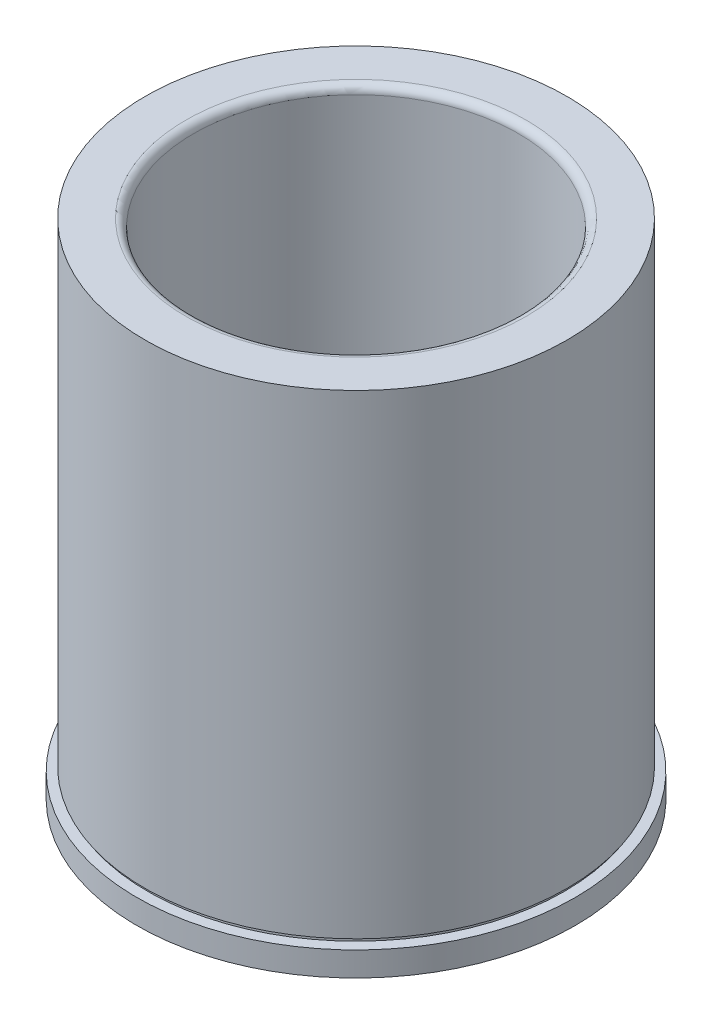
ISO-10303-21;
HEADER;
FILE_DESCRIPTION(('STEP AP214'),'2;1');
FILE_NAME('part.step','',(''),(''),'','','');
FILE_SCHEMA(('AUTOMOTIVE_DESIGN { 1 0 10303 214 1 1 1 1 }'));
ENDSEC;
DATA;
#1=APPLICATION_CONTEXT('core data for automotive mechanical design processes');
#2=APPLICATION_PROTOCOL_DEFINITION('international standard','automotive_design',2000,#1);
#3=PRODUCT_CONTEXT('',#1,'mechanical');
#4=PRODUCT('Part','Part','',(#3));
#5=PRODUCT_RELATED_PRODUCT_CATEGORY('part','',(#4));
#6=PRODUCT_DEFINITION_FORMATION('','',#4);
#7=PRODUCT_DEFINITION_CONTEXT('part definition',#1,'design');
#8=PRODUCT_DEFINITION('design','',#6,#7);
#9=PRODUCT_DEFINITION_SHAPE('','',#8);
#10=(LENGTH_UNIT() NAMED_UNIT(*) SI_UNIT(.MILLI.,.METRE.));
#11=(NAMED_UNIT(*) PLANE_ANGLE_UNIT() SI_UNIT($,.RADIAN.));
#12=(NAMED_UNIT(*) SI_UNIT($,.STERADIAN.) SOLID_ANGLE_UNIT());
#13=UNCERTAINTY_MEASURE_WITH_UNIT(LENGTH_MEASURE(1.E-05),#10,'distance_accuracy_value','');
#14=(GEOMETRIC_REPRESENTATION_CONTEXT(3) GLOBAL_UNCERTAINTY_ASSIGNED_CONTEXT((#13)) GLOBAL_UNIT_ASSIGNED_CONTEXT((#10,
#11,#12)) REPRESENTATION_CONTEXT('',''));
#15=CARTESIAN_POINT('',(0.,0.,0.));
#16=DIRECTION('',(0.,0.,1.));
#17=DIRECTION('',(1.,0.,0.));
#18=AXIS2_PLACEMENT_3D('',#15,#16,#17);
#19=CARTESIAN_POINT('',(-41.28135,114.350690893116,0.));
#20=DIRECTION('',(0.,-1.,0.));
#21=DIRECTION('',(1.,0.,0.));
#22=AXIS2_PLACEMENT_3D('',#19,#20,#21);
#23=PLANE('',#22);
#24=CARTESIAN_POINT('',(-3.99253534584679E-13,114.350690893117,0.));
#25=DIRECTION('',(0.,-1.,0.));
#26=DIRECTION('',(1.,0.,0.));
#27=AXIS2_PLACEMENT_3D('',#24,#25,#26);
#28=CIRCLE('',#27,33.2803499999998);
#29=CARTESIAN_POINT('',(33.2803499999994,114.350690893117,0.));
#30=VERTEX_POINT('',#29);
#31=EDGE_CURVE('E35',#30,#30,#28,.T.);
#32=ORIENTED_EDGE('',*,*,#31,.T.);
#33=EDGE_LOOP('',(#32));
#34=FACE_BOUND('',#33,.T.);
#35=CARTESIAN_POINT('',(-3.99253534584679E-13,114.350690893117,0.));
#36=DIRECTION('',(0.,-1.,0.));
#37=DIRECTION('',(1.,0.,0.));
#38=AXIS2_PLACEMENT_3D('',#35,#36,#37);
#39=CIRCLE('',#38,41.2813499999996);
#40=CARTESIAN_POINT('',(41.2813499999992,114.350690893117,0.));
#41=VERTEX_POINT('',#40);
#42=EDGE_CURVE('E63',#41,#41,#39,.T.);
#43=ORIENTED_EDGE('',*,*,#42,.F.);
#44=EDGE_LOOP('',(#43));
#45=FACE_BOUND('',#44,.T.);
#46=ADVANCED_FACE('F28',(#34,#45),#23,.F.);
#47=CARTESIAN_POINT('',(3.49148336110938E-12,-1000.,0.));
#48=DIRECTION('',(0.,-1.,0.));
#49=DIRECTION('',(1.,0.,0.));
#50=AXIS2_PLACEMENT_3D('',#47,#48,#49);
#51=CYLINDRICAL_SURFACE('',#50,31.7563499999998);
#52=CARTESIAN_POINT('',(-3.93932513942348E-13,112.826690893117,0.));
#53=DIRECTION('',(0.,-1.,0.));
#54=DIRECTION('',(1.,0.,0.));
#55=AXIS2_PLACEMENT_3D('',#52,#53,#54);
#56=CIRCLE('',#55,31.7563499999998);
#57=CARTESIAN_POINT('',(31.7563499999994,112.826690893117,0.));
#58=VERTEX_POINT('',#57);
#59=EDGE_CURVE('E10',#58,#58,#56,.F.);
#60=ORIENTED_EDGE('',*,*,#59,.T.);
#61=EDGE_LOOP('',(#60));
#62=FACE_BOUND('',#61,.T.);
#63=CARTESIAN_POINT('',(0.,16.7417464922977,0.));
#64=DIRECTION('',(0.,-1.,0.));
#65=DIRECTION('',(1.,0.,0.));
#66=AXIS2_PLACEMENT_3D('',#63,#64,#65);
#67=CIRCLE('',#66,31.7563499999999);
#68=CARTESIAN_POINT('',(31.7563499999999,16.7417464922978,0.));
#69=VERTEX_POINT('',#68);
#70=EDGE_CURVE('E39',#69,#69,#67,.T.);
#71=ORIENTED_EDGE('',*,*,#70,.T.);
#72=EDGE_LOOP('',(#71));
#73=FACE_BOUND('',#72,.T.);
#74=ADVANCED_FACE('F70',(#62,#73),#51,.F.);
#75=CARTESIAN_POINT('',(0.,15.9256908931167,0.));
#76=DIRECTION('',(0.,-1.,0.));
#77=DIRECTION('',(1.,0.,0.));
#78=AXIS2_PLACEMENT_3D('',#75,#76,#77);
#79=CONICAL_SURFACE('',#78,32.5724055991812,0.785398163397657);
#80=ORIENTED_EDGE('',*,*,#70,.F.);
#81=EDGE_LOOP('',(#80));
#82=FACE_BOUND('',#81,.T.);
#83=CARTESIAN_POINT('',(0.,15.9256908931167,0.));
#84=DIRECTION('',(0.,-1.,0.));
#85=DIRECTION('',(1.,0.,0.));
#86=AXIS2_PLACEMENT_3D('',#83,#84,#85);
#87=CIRCLE('',#86,32.5724055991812);
#88=CARTESIAN_POINT('',(32.5724055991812,15.9256908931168,0.));
#89=VERTEX_POINT('',#88);
#90=EDGE_CURVE('E43',#89,#89,#87,.T.);
#91=ORIENTED_EDGE('',*,*,#90,.T.);
#92=EDGE_LOOP('',(#91));
#93=FACE_BOUND('',#92,.T.);
#94=ADVANCED_FACE('F74',(#82,#93),#79,.F.);
#95=CARTESIAN_POINT('',(-32.5724055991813,15.9256908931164,0.));
#96=DIRECTION('',(0.,1.,0.));
#97=DIRECTION('',(-1.,0.,0.));
#98=AXIS2_PLACEMENT_3D('',#95,#96,#97);
#99=PLANE('',#98);
#100=ORIENTED_EDGE('',*,*,#90,.F.);
#101=EDGE_LOOP('',(#100));
#102=FACE_BOUND('',#101,.T.);
#103=CARTESIAN_POINT('',(0.,15.9256908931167,0.));
#104=DIRECTION('',(0.,-1.,0.));
#105=DIRECTION('',(1.,0.,0.));
#106=AXIS2_PLACEMENT_3D('',#103,#104,#105);
#107=CIRCLE('',#106,42.8624999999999);
#108=CARTESIAN_POINT('',(42.8624999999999,15.9256908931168,0.));
#109=VERTEX_POINT('',#108);
#110=EDGE_CURVE('E48',#109,#109,#107,.T.);
#111=ORIENTED_EDGE('',*,*,#110,.T.);
#112=EDGE_LOOP('',(#111));
#113=FACE_BOUND('',#112,.T.);
#114=ADVANCED_FACE('F79',(#102,#113),#99,.F.);
#115=CARTESIAN_POINT('',(3.49148336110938E-12,-1000.,0.));
#116=DIRECTION('',(0.,-1.,0.));
#117=DIRECTION('',(1.,0.,0.));
#118=AXIS2_PLACEMENT_3D('',#115,#116,#117);
#119=CYLINDRICAL_SURFACE('',#118,42.8624999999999);
#120=ORIENTED_EDGE('',*,*,#110,.F.);
#121=EDGE_LOOP('',(#120));
#122=FACE_BOUND('',#121,.T.);
#123=CARTESIAN_POINT('',(0.,20.6881908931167,0.));
#124=DIRECTION('',(0.,-1.,0.));
#125=DIRECTION('',(1.,0.,0.));
#126=AXIS2_PLACEMENT_3D('',#123,#124,#125);
#127=CIRCLE('',#126,42.8624999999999);
#128=CARTESIAN_POINT('',(42.8624999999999,20.6881908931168,0.));
#129=VERTEX_POINT('',#128);
#130=EDGE_CURVE('E51',#129,#129,#127,.T.);
#131=ORIENTED_EDGE('',*,*,#130,.T.);
#132=EDGE_LOOP('',(#131));
#133=FACE_BOUND('',#132,.T.);
#134=ADVANCED_FACE('F83',(#122,#133),#119,.T.);
#135=CARTESIAN_POINT('',(-42.8625,20.6881908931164,0.));
#136=DIRECTION('',(0.,-1.,0.));
#137=DIRECTION('',(1.,0.,0.));
#138=AXIS2_PLACEMENT_3D('',#135,#136,#137);
#139=PLANE('',#138);
#140=ORIENTED_EDGE('',*,*,#130,.F.);
#141=EDGE_LOOP('',(#140));
#142=FACE_BOUND('',#141,.T.);
#143=CARTESIAN_POINT('',(0.,20.6881908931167,0.));
#144=DIRECTION('',(0.,-1.,0.));
#145=DIRECTION('',(1.,0.,0.));
#146=AXIS2_PLACEMENT_3D('',#143,#144,#145);
#147=CIRCLE('',#146,40.7733499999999);
#148=CARTESIAN_POINT('',(40.7733499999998,20.6881908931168,0.));
#149=VERTEX_POINT('',#148);
#150=EDGE_CURVE('E54',#149,#149,#147,.T.);
#151=ORIENTED_EDGE('',*,*,#150,.T.);
#152=EDGE_LOOP('',(#151));
#153=FACE_BOUND('',#152,.T.);
#154=ADVANCED_FACE('F87',(#142,#153),#139,.F.);
#155=CARTESIAN_POINT('',(3.49148336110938E-12,-1000.,0.));
#156=DIRECTION('',(0.,-1.,0.));
#157=DIRECTION('',(1.,0.,0.));
#158=AXIS2_PLACEMENT_3D('',#155,#156,#157);
#159=CYLINDRICAL_SURFACE('',#158,40.7733499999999);
#160=ORIENTED_EDGE('',*,*,#150,.F.);
#161=EDGE_LOOP('',(#160));
#162=FACE_BOUND('',#161,.T.);
#163=CARTESIAN_POINT('',(0.,21.4501908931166,0.));
#164=DIRECTION('',(0.,-1.,0.));
#165=DIRECTION('',(1.,0.,0.));
#166=AXIS2_PLACEMENT_3D('',#163,#164,#165);
#167=CIRCLE('',#166,40.7733499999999);
#168=CARTESIAN_POINT('',(40.7733499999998,21.4501908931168,0.));
#169=VERTEX_POINT('',#168);
#170=EDGE_CURVE('E57',#169,#169,#167,.T.);
#171=ORIENTED_EDGE('',*,*,#170,.T.);
#172=EDGE_LOOP('',(#171));
#173=FACE_BOUND('',#172,.T.);
#174=ADVANCED_FACE('F91',(#162,#173),#159,.T.);
#175=CARTESIAN_POINT('',(-41.28135,21.4501908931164,0.));
#176=DIRECTION('',(0.,1.,0.));
#177=DIRECTION('',(-1.,0.,0.));
#178=AXIS2_PLACEMENT_3D('',#175,#176,#177);
#179=PLANE('',#178);
#180=ORIENTED_EDGE('',*,*,#170,.F.);
#181=EDGE_LOOP('',(#180));
#182=FACE_BOUND('',#181,.T.);
#183=CARTESIAN_POINT('',(0.,21.4501908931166,0.));
#184=DIRECTION('',(0.,-1.,0.));
#185=DIRECTION('',(1.,0.,0.));
#186=AXIS2_PLACEMENT_3D('',#183,#184,#185);
#187=CIRCLE('',#186,41.2813499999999);
#188=CARTESIAN_POINT('',(41.2813499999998,21.4501908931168,0.));
#189=VERTEX_POINT('',#188);
#190=EDGE_CURVE('E60',#189,#189,#187,.T.);
#191=ORIENTED_EDGE('',*,*,#190,.T.);
#192=EDGE_LOOP('',(#191));
#193=FACE_BOUND('',#192,.T.);
#194=ADVANCED_FACE('F95',(#182,#193),#179,.F.);
#195=CARTESIAN_POINT('',(3.49148336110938E-12,-1000.,0.));
#196=DIRECTION('',(0.,-1.,0.));
#197=DIRECTION('',(1.,0.,0.));
#198=AXIS2_PLACEMENT_3D('',#195,#196,#197);
#199=CYLINDRICAL_SURFACE('',#198,41.2813499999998);
#200=ORIENTED_EDGE('',*,*,#190,.F.);
#201=EDGE_LOOP('',(#200));
#202=FACE_BOUND('',#201,.T.);
#203=ORIENTED_EDGE('',*,*,#42,.T.);
#204=EDGE_LOOP('',(#203));
#205=FACE_BOUND('',#204,.T.);
#206=ADVANCED_FACE('F67',(#202,#205),#199,.T.);
#207=CARTESIAN_POINT('',(-3.93932513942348E-13,112.826690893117,0.));
#208=DIRECTION('',(0.,-1.,0.));
#209=DIRECTION('',(1.,0.,0.));
#210=AXIS2_PLACEMENT_3D('',#207,#208,#209);
#211=TOROIDAL_SURFACE('',#210,33.2803499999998,1.524);
#212=ORIENTED_EDGE('',*,*,#59,.F.);
#213=EDGE_LOOP('',(#212));
#214=FACE_BOUND('',#213,.T.);
#215=ORIENTED_EDGE('',*,*,#31,.F.);
#216=EDGE_LOOP('',(#215));
#217=FACE_BOUND('',#216,.T.);
#218=ADVANCED_FACE('F30',(#214,#217),#211,.T.);
#219=CLOSED_SHELL('',(#46,#74,#94,#114,#134,#154,#174,#194,#206,#218));
#220=MANIFOLD_SOLID_BREP('B2',#219);
#221=ADVANCED_BREP_SHAPE_REPRESENTATION('',(#18,#220),#14);
#222=SHAPE_DEFINITION_REPRESENTATION(#9,#221);
ENDSEC;
END-ISO-10303-21;
